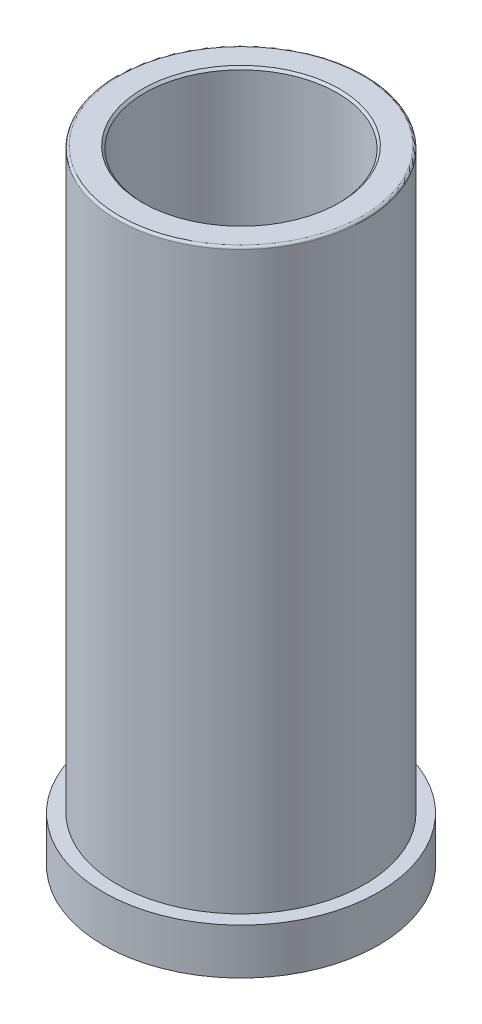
ISO-10303-21;
HEADER;
FILE_DESCRIPTION(('STEP AP214'),'2;1');
FILE_NAME('part.step','',(''),(''),'','','');
FILE_SCHEMA(('AUTOMOTIVE_DESIGN { 1 0 10303 214 1 1 1 1 }'));
ENDSEC;
DATA;
#1=APPLICATION_CONTEXT('core data for automotive mechanical design processes');
#2=APPLICATION_PROTOCOL_DEFINITION('international standard','automotive_design',2000,#1);
#3=PRODUCT_CONTEXT('',#1,'mechanical');
#4=PRODUCT('Part','Part','',(#3));
#5=PRODUCT_RELATED_PRODUCT_CATEGORY('part','',(#4));
#6=PRODUCT_DEFINITION_FORMATION('','',#4);
#7=PRODUCT_DEFINITION_CONTEXT('part definition',#1,'design');
#8=PRODUCT_DEFINITION('design','',#6,#7);
#9=PRODUCT_DEFINITION_SHAPE('','',#8);
#10=(LENGTH_UNIT() NAMED_UNIT(*) SI_UNIT(.MILLI.,.METRE.));
#11=(NAMED_UNIT(*) PLANE_ANGLE_UNIT() SI_UNIT($,.RADIAN.));
#12=(NAMED_UNIT(*) SI_UNIT($,.STERADIAN.) SOLID_ANGLE_UNIT());
#13=UNCERTAINTY_MEASURE_WITH_UNIT(LENGTH_MEASURE(1.E-05),#10,'distance_accuracy_value','');
#14=(GEOMETRIC_REPRESENTATION_CONTEXT(3) GLOBAL_UNCERTAINTY_ASSIGNED_CONTEXT((#13)) GLOBAL_UNIT_ASSIGNED_CONTEXT((#10,
#11,#12)) REPRESENTATION_CONTEXT('',''));
#15=CARTESIAN_POINT('',(0.,0.,0.));
#16=DIRECTION('',(0.,0.,1.));
#17=DIRECTION('',(1.,0.,0.));
#18=AXIS2_PLACEMENT_3D('',#15,#16,#17);
#19=CARTESIAN_POINT('',(0.,0.,0.));
#20=DIRECTION('',(0.,-1.,0.));
#21=DIRECTION('',(0.,0.,-1.));
#22=AXIS2_PLACEMENT_3D('',#19,#20,#21);
#23=CYLINDRICAL_SURFACE('',#22,27.);
#24=CARTESIAN_POINT('',(0.,125.5,0.));
#25=DIRECTION('',(0.,-1.,0.));
#26=DIRECTION('',(0.,0.,-1.));
#27=AXIS2_PLACEMENT_3D('',#24,#25,#26);
#28=CIRCLE('',#27,27.);
#29=CARTESIAN_POINT('',(0.,125.5,-27.));
#30=VERTEX_POINT('',#29);
#31=EDGE_CURVE('E21',#30,#30,#28,.T.);
#32=ORIENTED_EDGE('',*,*,#31,.T.);
#33=EDGE_LOOP('',(#32));
#34=FACE_BOUND('',#33,.T.);
#35=CARTESIAN_POINT('',(0.,0.,0.));
#36=DIRECTION('',(0.,-1.,0.));
#37=DIRECTION('',(0.,0.,-1.));
#38=AXIS2_PLACEMENT_3D('',#35,#36,#37);
#39=CIRCLE('',#38,27.);
#40=CARTESIAN_POINT('',(0.,0.,-27.));
#41=VERTEX_POINT('',#40);
#42=EDGE_CURVE('E52',#41,#41,#39,.T.);
#43=ORIENTED_EDGE('',*,*,#42,.F.);
#44=EDGE_LOOP('',(#43));
#45=FACE_BOUND('',#44,.T.);
#46=ADVANCED_FACE('F14',(#34,#45),#23,.T.);
#47=CARTESIAN_POINT('',(-27.,126.,0.));
#48=DIRECTION('',(0.,-1.,0.));
#49=DIRECTION('',(0.,0.,-1.));
#50=AXIS2_PLACEMENT_3D('',#47,#48,#49);
#51=PLANE('',#50);
#52=CARTESIAN_POINT('',(0.,126.,0.));
#53=DIRECTION('',(0.,-1.,0.));
#54=DIRECTION('',(0.,0.,-1.));
#55=AXIS2_PLACEMENT_3D('',#52,#53,#54);
#56=CIRCLE('',#55,26.5);
#57=CARTESIAN_POINT('',(0.,126.,-26.5));
#58=VERTEX_POINT('',#57);
#59=EDGE_CURVE('E9',#58,#58,#56,.F.);
#60=ORIENTED_EDGE('',*,*,#59,.T.);
#61=EDGE_LOOP('',(#60));
#62=FACE_BOUND('',#61,.T.);
#63=CARTESIAN_POINT('',(0.,126.,0.));
#64=DIRECTION('',(0.,-1.,0.));
#65=DIRECTION('',(0.,0.,-1.));
#66=AXIS2_PLACEMENT_3D('',#63,#64,#65);
#67=CIRCLE('',#66,21.5);
#68=CARTESIAN_POINT('',(0.,126.,-21.5));
#69=VERTEX_POINT('',#68);
#70=EDGE_CURVE('E37',#69,#69,#67,.T.);
#71=ORIENTED_EDGE('',*,*,#70,.T.);
#72=EDGE_LOOP('',(#71));
#73=FACE_BOUND('',#72,.T.);
#74=ADVANCED_FACE('F59',(#62,#73),#51,.F.);
#75=CARTESIAN_POINT('',(0.,0.,0.));
#76=DIRECTION('',(0.,-1.,0.));
#77=DIRECTION('',(0.,0.,-1.));
#78=AXIS2_PLACEMENT_3D('',#75,#76,#77);
#79=CYLINDRICAL_SURFACE('',#78,21.);
#80=CARTESIAN_POINT('',(0.,125.5,0.));
#81=DIRECTION('',(0.,-1.,0.));
#82=DIRECTION('',(0.,0.,-1.));
#83=AXIS2_PLACEMENT_3D('',#80,#81,#82);
#84=CIRCLE('',#83,21.);
#85=CARTESIAN_POINT('',(0.,125.5,-21.));
#86=VERTEX_POINT('',#85);
#87=EDGE_CURVE('E34',#86,#86,#84,.F.);
#88=ORIENTED_EDGE('',*,*,#87,.T.);
#89=EDGE_LOOP('',(#88));
#90=FACE_BOUND('',#89,.T.);
#91=CARTESIAN_POINT('',(0.,10.,0.));
#92=DIRECTION('',(0.,-1.,0.));
#93=DIRECTION('',(0.,0.,-1.));
#94=AXIS2_PLACEMENT_3D('',#91,#92,#93);
#95=CIRCLE('',#94,21.);
#96=CARTESIAN_POINT('',(0.,10.,-21.));
#97=VERTEX_POINT('',#96);
#98=EDGE_CURVE('E40',#97,#97,#95,.T.);
#99=ORIENTED_EDGE('',*,*,#98,.T.);
#100=EDGE_LOOP('',(#99));
#101=FACE_BOUND('',#100,.T.);
#102=ADVANCED_FACE('F66',(#90,#101),#79,.F.);
#103=CARTESIAN_POINT('',(0.,9.85,0.));
#104=DIRECTION('',(0.,-1.,0.));
#105=DIRECTION('',(0.,0.,-1.));
#106=AXIS2_PLACEMENT_3D('',#103,#104,#105);
#107=CONICAL_SURFACE('',#106,21.1,0.588002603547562);
#108=ORIENTED_EDGE('',*,*,#98,.F.);
#109=EDGE_LOOP('',(#108));
#110=FACE_BOUND('',#109,.T.);
#111=CARTESIAN_POINT('',(0.,9.85,0.));
#112=DIRECTION('',(0.,-1.,0.));
#113=DIRECTION('',(0.,0.,-1.));
#114=AXIS2_PLACEMENT_3D('',#111,#112,#113);
#115=CIRCLE('',#114,21.1);
#116=CARTESIAN_POINT('',(0.,9.85,-21.1));
#117=VERTEX_POINT('',#116);
#118=EDGE_CURVE('E43',#117,#117,#115,.T.);
#119=ORIENTED_EDGE('',*,*,#118,.T.);
#120=EDGE_LOOP('',(#119));
#121=FACE_BOUND('',#120,.T.);
#122=ADVANCED_FACE('F89',(#110,#121),#107,.F.);
#123=CARTESIAN_POINT('',(0.,0.,0.));
#124=DIRECTION('',(0.,-1.,0.));
#125=DIRECTION('',(0.,0.,-1.));
#126=AXIS2_PLACEMENT_3D('',#123,#124,#125);
#127=CYLINDRICAL_SURFACE('',#126,21.1);
#128=CARTESIAN_POINT('',(0.,-9.5,0.));
#129=DIRECTION('',(0.,1.,0.));
#130=DIRECTION('',(0.,0.,1.));
#131=AXIS2_PLACEMENT_3D('',#128,#129,#130);
#132=CIRCLE('',#131,21.1);
#133=CARTESIAN_POINT('',(0.,-9.5,21.1));
#134=VERTEX_POINT('',#133);
#135=EDGE_CURVE('E29',#134,#134,#132,.F.);
#136=ORIENTED_EDGE('',*,*,#135,.T.);
#137=EDGE_LOOP('',(#136));
#138=FACE_BOUND('',#137,.T.);
#139=ORIENTED_EDGE('',*,*,#118,.F.);
#140=EDGE_LOOP('',(#139));
#141=FACE_BOUND('',#140,.T.);
#142=ADVANCED_FACE('F85',(#138,#141),#127,.F.);
#143=CARTESIAN_POINT('',(-21.1,-10.,0.));
#144=DIRECTION('',(0.,1.,0.));
#145=DIRECTION('',(0.,0.,1.));
#146=AXIS2_PLACEMENT_3D('',#143,#144,#145);
#147=PLANE('',#146);
#148=CARTESIAN_POINT('',(0.,-10.,0.));
#149=DIRECTION('',(0.,1.,0.));
#150=DIRECTION('',(0.,0.,1.));
#151=AXIS2_PLACEMENT_3D('',#148,#149,#150);
#152=CIRCLE('',#151,21.6);
#153=CARTESIAN_POINT('',(0.,-10.,21.6));
#154=VERTEX_POINT('',#153);
#155=EDGE_CURVE('E25',#154,#154,#152,.T.);
#156=ORIENTED_EDGE('',*,*,#155,.T.);
#157=EDGE_LOOP('',(#156));
#158=FACE_BOUND('',#157,.T.);
#159=CARTESIAN_POINT('',(0.,-10.,0.));
#160=DIRECTION('',(0.,-1.,0.));
#161=DIRECTION('',(0.,0.,-1.));
#162=AXIS2_PLACEMENT_3D('',#159,#160,#161);
#163=CIRCLE('',#162,30.);
#164=CARTESIAN_POINT('',(0.,-10.,-30.));
#165=VERTEX_POINT('',#164);
#166=EDGE_CURVE('E46',#165,#165,#163,.T.);
#167=ORIENTED_EDGE('',*,*,#166,.T.);
#168=EDGE_LOOP('',(#167));
#169=FACE_BOUND('',#168,.T.);
#170=ADVANCED_FACE('F88',(#158,#169),#147,.F.);
#171=CARTESIAN_POINT('',(0.,0.,0.));
#172=DIRECTION('',(0.,-1.,0.));
#173=DIRECTION('',(0.,0.,-1.));
#174=AXIS2_PLACEMENT_3D('',#171,#172,#173);
#175=CYLINDRICAL_SURFACE('',#174,30.);
#176=ORIENTED_EDGE('',*,*,#166,.F.);
#177=EDGE_LOOP('',(#176));
#178=FACE_BOUND('',#177,.T.);
#179=CARTESIAN_POINT('',(0.,0.,0.));
#180=DIRECTION('',(0.,-1.,0.));
#181=DIRECTION('',(0.,0.,-1.));
#182=AXIS2_PLACEMENT_3D('',#179,#180,#181);
#183=CIRCLE('',#182,30.);
#184=CARTESIAN_POINT('',(0.,0.,-30.));
#185=VERTEX_POINT('',#184);
#186=EDGE_CURVE('E49',#185,#185,#183,.T.);
#187=ORIENTED_EDGE('',*,*,#186,.T.);
#188=EDGE_LOOP('',(#187));
#189=FACE_BOUND('',#188,.T.);
#190=ADVANCED_FACE('F105',(#178,#189),#175,.T.);
#191=CARTESIAN_POINT('',(-30.,0.,0.));
#192=DIRECTION('',(0.,-1.,0.));
#193=DIRECTION('',(0.,0.,-1.));
#194=AXIS2_PLACEMENT_3D('',#191,#192,#193);
#195=PLANE('',#194);
#196=ORIENTED_EDGE('',*,*,#186,.F.);
#197=EDGE_LOOP('',(#196));
#198=FACE_BOUND('',#197,.T.);
#199=ORIENTED_EDGE('',*,*,#42,.T.);
#200=EDGE_LOOP('',(#199));
#201=FACE_BOUND('',#200,.T.);
#202=ADVANCED_FACE('F56',(#198,#201),#195,.F.);
#203=CARTESIAN_POINT('',(0.,126.,0.));
#204=DIRECTION('',(0.,1.,0.));
#205=DIRECTION('',(0.,0.,1.));
#206=AXIS2_PLACEMENT_3D('',#203,#204,#205);
#207=CONICAL_SURFACE('',#206,21.5,0.785398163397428);
#208=ORIENTED_EDGE('',*,*,#87,.F.);
#209=EDGE_LOOP('',(#208));
#210=FACE_BOUND('',#209,.T.);
#211=ORIENTED_EDGE('',*,*,#70,.F.);
#212=EDGE_LOOP('',(#211));
#213=FACE_BOUND('',#212,.T.);
#214=ADVANCED_FACE('F70',(#210,#213),#207,.F.);
#215=CARTESIAN_POINT('',(0.,-9.5,0.));
#216=DIRECTION('',(0.,-1.,0.));
#217=DIRECTION('',(0.,0.,-1.));
#218=AXIS2_PLACEMENT_3D('',#215,#216,#217);
#219=CONICAL_SURFACE('',#218,21.1,0.785398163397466);
#220=ORIENTED_EDGE('',*,*,#155,.F.);
#221=EDGE_LOOP('',(#220));
#222=FACE_BOUND('',#221,.T.);
#223=ORIENTED_EDGE('',*,*,#135,.F.);
#224=EDGE_LOOP('',(#223));
#225=FACE_BOUND('',#224,.T.);
#226=ADVANCED_FACE('F72',(#222,#225),#219,.F.);
#227=CARTESIAN_POINT('',(0.,125.5,0.));
#228=DIRECTION('',(0.,-1.,0.));
#229=DIRECTION('',(0.,0.,-1.));
#230=AXIS2_PLACEMENT_3D('',#227,#228,#229);
#231=TOROIDAL_SURFACE('',#230,26.5,0.5);
#232=ORIENTED_EDGE('',*,*,#59,.F.);
#233=EDGE_LOOP('',(#232));
#234=FACE_BOUND('',#233,.T.);
#235=ORIENTED_EDGE('',*,*,#31,.F.);
#236=EDGE_LOOP('',(#235));
#237=FACE_BOUND('',#236,.T.);
#238=ADVANCED_FACE('F16',(#234,#237),#231,.T.);
#239=CLOSED_SHELL('',(#46,#74,#102,#122,#142,#170,#190,#202,#214,#226,#238));
#240=MANIFOLD_SOLID_BREP('B1',#239);
#241=ADVANCED_BREP_SHAPE_REPRESENTATION('',(#18,#240),#14);
#242=SHAPE_DEFINITION_REPRESENTATION(#9,#241);
ENDSEC;
END-ISO-10303-21;
